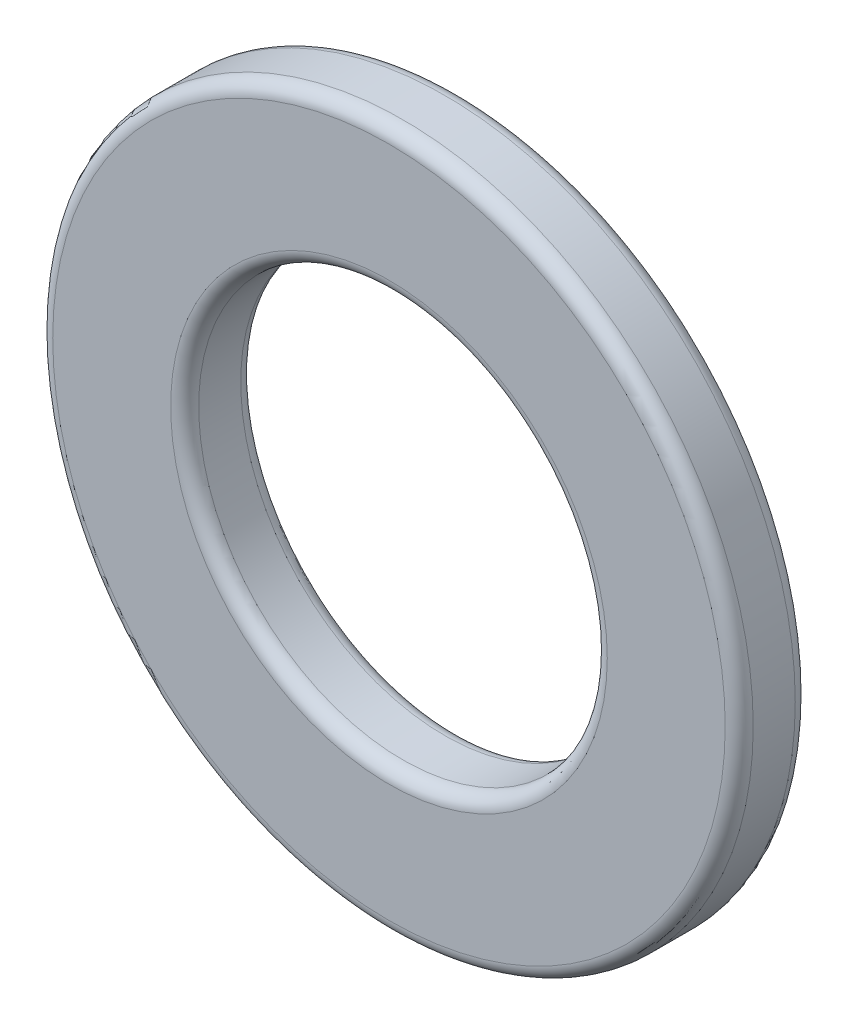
ISO-10303-21;
HEADER;
FILE_DESCRIPTION(('STEP AP214'),'2;1');
FILE_NAME('part.step','',(''),(''),'','','');
FILE_SCHEMA(('AUTOMOTIVE_DESIGN { 1 0 10303 214 1 1 1 1 }'));
ENDSEC;
DATA;
#1=APPLICATION_CONTEXT('core data for automotive mechanical design processes');
#2=APPLICATION_PROTOCOL_DEFINITION('international standard','automotive_design',2000,#1);
#3=PRODUCT_CONTEXT('',#1,'mechanical');
#4=PRODUCT('Part','Part','',(#3));
#5=PRODUCT_RELATED_PRODUCT_CATEGORY('part','',(#4));
#6=PRODUCT_DEFINITION_FORMATION('','',#4);
#7=PRODUCT_DEFINITION_CONTEXT('part definition',#1,'design');
#8=PRODUCT_DEFINITION('design','',#6,#7);
#9=PRODUCT_DEFINITION_SHAPE('','',#8);
#10=(LENGTH_UNIT() NAMED_UNIT(*) SI_UNIT(.MILLI.,.METRE.));
#11=(NAMED_UNIT(*) PLANE_ANGLE_UNIT() SI_UNIT($,.RADIAN.));
#12=(NAMED_UNIT(*) SI_UNIT($,.STERADIAN.) SOLID_ANGLE_UNIT());
#13=UNCERTAINTY_MEASURE_WITH_UNIT(LENGTH_MEASURE(1.E-05),#10,'distance_accuracy_value','');
#14=(GEOMETRIC_REPRESENTATION_CONTEXT(3) GLOBAL_UNCERTAINTY_ASSIGNED_CONTEXT((#13)) GLOBAL_UNIT_ASSIGNED_CONTEXT((#10,
#11,#12)) REPRESENTATION_CONTEXT('',''));
#15=CARTESIAN_POINT('',(0.,0.,0.));
#16=DIRECTION('',(0.,0.,1.));
#17=DIRECTION('',(1.,0.,0.));
#18=AXIS2_PLACEMENT_3D('',#15,#16,#17);
#19=CARTESIAN_POINT('',(0.,0.,-0.9));
#20=DIRECTION('',(0.,0.,1.));
#21=DIRECTION('',(1.,0.,0.));
#22=AXIS2_PLACEMENT_3D('',#19,#20,#21);
#23=CYLINDRICAL_SURFACE('',#22,9.);
#24=CARTESIAN_POINT('',(0.,0.,-0.54));
#25=DIRECTION('',(0.,0.,1.));
#26=DIRECTION('',(1.,0.,0.));
#27=AXIS2_PLACEMENT_3D('',#24,#25,#26);
#28=CIRCLE('',#27,9.);
#29=CARTESIAN_POINT('',(9.,0.,-0.54));
#30=VERTEX_POINT('',#29);
#31=EDGE_CURVE('E109',#30,#30,#28,.T.);
#32=ORIENTED_EDGE('',*,*,#31,.T.);
#33=EDGE_LOOP('',(#32));
#34=FACE_BOUND('',#33,.T.);
#35=CARTESIAN_POINT('',(0.,0.,0.54));
#36=DIRECTION('',(0.,0.,1.));
#37=DIRECTION('',(1.,0.,0.));
#38=AXIS2_PLACEMENT_3D('',#35,#36,#37);
#39=CIRCLE('',#38,9.);
#40=CARTESIAN_POINT('',(9.,0.,0.54));
#41=VERTEX_POINT('',#40);
#42=EDGE_CURVE('E112',#41,#41,#39,.F.);
#43=ORIENTED_EDGE('',*,*,#42,.T.);
#44=EDGE_LOOP('',(#43));
#45=FACE_BOUND('',#44,.T.);
#46=ADVANCED_FACE('F83',(#34,#45),#23,.T.);
#47=CARTESIAN_POINT('',(0.,0.,-0.9));
#48=DIRECTION('',(0.,0.,1.));
#49=DIRECTION('',(1.,0.,0.));
#50=AXIS2_PLACEMENT_3D('',#47,#48,#49);
#51=PLANE('',#50);
#52=CARTESIAN_POINT('',(0.,0.,-0.9));
#53=DIRECTION('',(0.,0.,1.));
#54=DIRECTION('',(1.,0.,0.));
#55=AXIS2_PLACEMENT_3D('',#52,#53,#54);
#56=CIRCLE('',#55,8.64);
#57=CARTESIAN_POINT('',(8.64,0.,-0.9));
#58=VERTEX_POINT('',#57);
#59=EDGE_CURVE('E103',#58,#58,#56,.F.);
#60=ORIENTED_EDGE('',*,*,#59,.T.);
#61=EDGE_LOOP('',(#60));
#62=FACE_BOUND('',#61,.T.);
#63=CARTESIAN_POINT('',(0.,0.,-0.9));
#64=DIRECTION('',(0.,0.,1.));
#65=DIRECTION('',(1.,0.,0.));
#66=AXIS2_PLACEMENT_3D('',#63,#64,#65);
#67=CIRCLE('',#66,5.61);
#68=CARTESIAN_POINT('',(5.61,0.,-0.9));
#69=VERTEX_POINT('',#68);
#70=EDGE_CURVE('E106',#69,#69,#67,.T.);
#71=ORIENTED_EDGE('',*,*,#70,.T.);
#72=EDGE_LOOP('',(#71));
#73=FACE_BOUND('',#72,.T.);
#74=ADVANCED_FACE('F126',(#62,#73),#51,.F.);
#75=CARTESIAN_POINT('',(0.,0.,-0.9));
#76=DIRECTION('',(0.,0.,1.));
#77=DIRECTION('',(1.,0.,0.));
#78=AXIS2_PLACEMENT_3D('',#75,#76,#77);
#79=CYLINDRICAL_SURFACE('',#78,5.25);
#80=CARTESIAN_POINT('',(0.,0.,-0.54));
#81=DIRECTION('',(0.,0.,1.));
#82=DIRECTION('',(1.,0.,0.));
#83=AXIS2_PLACEMENT_3D('',#80,#81,#82);
#84=CIRCLE('',#83,5.25);
#85=CARTESIAN_POINT('',(5.25,0.,-0.54));
#86=VERTEX_POINT('',#85);
#87=EDGE_CURVE('E94',#86,#86,#84,.F.);
#88=ORIENTED_EDGE('',*,*,#87,.T.);
#89=EDGE_LOOP('',(#88));
#90=FACE_BOUND('',#89,.T.);
#91=CARTESIAN_POINT('',(0.,0.,0.54));
#92=DIRECTION('',(0.,0.,1.));
#93=DIRECTION('',(1.,0.,0.));
#94=AXIS2_PLACEMENT_3D('',#91,#92,#93);
#95=CIRCLE('',#94,5.25);
#96=CARTESIAN_POINT('',(5.25,0.,0.54));
#97=VERTEX_POINT('',#96);
#98=EDGE_CURVE('E98',#97,#97,#95,.T.);
#99=ORIENTED_EDGE('',*,*,#98,.T.);
#100=EDGE_LOOP('',(#99));
#101=FACE_BOUND('',#100,.T.);
#102=ADVANCED_FACE('F132',(#90,#101),#79,.F.);
#103=CARTESIAN_POINT('',(0.,0.,0.9));
#104=DIRECTION('',(0.,0.,1.));
#105=DIRECTION('',(1.,0.,0.));
#106=AXIS2_PLACEMENT_3D('',#103,#104,#105);
#107=PLANE('',#106);
#108=CARTESIAN_POINT('',(0.,0.,0.9));
#109=DIRECTION('',(0.,0.,1.));
#110=DIRECTION('',(1.,0.,0.));
#111=AXIS2_PLACEMENT_3D('',#108,#109,#110);
#112=CIRCLE('',#111,5.61);
#113=CARTESIAN_POINT('',(5.61,0.,0.9));
#114=VERTEX_POINT('',#113);
#115=EDGE_CURVE('E11',#114,#114,#112,.F.);
#116=ORIENTED_EDGE('',*,*,#115,.T.);
#117=EDGE_LOOP('',(#116));
#118=FACE_BOUND('',#117,.T.);
#119=CARTESIAN_POINT('',(0.,0.,0.9));
#120=DIRECTION('',(0.,0.,1.));
#121=DIRECTION('',(1.,0.,0.));
#122=AXIS2_PLACEMENT_3D('',#119,#120,#121);
#123=CIRCLE('',#122,8.64);
#124=CARTESIAN_POINT('',(8.64,0.,0.9));
#125=VERTEX_POINT('',#124);
#126=EDGE_CURVE('E90',#125,#125,#123,.T.);
#127=ORIENTED_EDGE('',*,*,#126,.T.);
#128=EDGE_LOOP('',(#127));
#129=FACE_BOUND('',#128,.T.);
#130=ADVANCED_FACE('F140',(#118,#129),#107,.T.);
#131=CARTESIAN_POINT('',(0.,0.,-0.54));
#132=DIRECTION('',(0.,0.,1.));
#133=DIRECTION('',(1.,0.,0.));
#134=AXIS2_PLACEMENT_3D('',#131,#132,#133);
#135=TOROIDAL_SURFACE('',#134,8.64,0.36);
#136=ORIENTED_EDGE('',*,*,#59,.F.);
#137=EDGE_LOOP('',(#136));
#138=FACE_BOUND('',#137,.T.);
#139=ORIENTED_EDGE('',*,*,#31,.F.);
#140=EDGE_LOOP('',(#139));
#141=FACE_BOUND('',#140,.T.);
#142=ADVANCED_FACE('F137',(#138,#141),#135,.T.);
#143=CARTESIAN_POINT('',(0.,0.,-0.54));
#144=DIRECTION('',(0.,0.,1.));
#145=DIRECTION('',(1.,0.,0.));
#146=AXIS2_PLACEMENT_3D('',#143,#144,#145);
#147=TOROIDAL_SURFACE('',#146,5.61,0.36);
#148=ORIENTED_EDGE('',*,*,#87,.F.);
#149=EDGE_LOOP('',(#148));
#150=FACE_BOUND('',#149,.T.);
#151=ORIENTED_EDGE('',*,*,#70,.F.);
#152=EDGE_LOOP('',(#151));
#153=FACE_BOUND('',#152,.T.);
#154=ADVANCED_FACE('F123',(#150,#153),#147,.T.);
#155=CARTESIAN_POINT('',(0.,0.,0.54));
#156=DIRECTION('',(0.,0.,1.));
#157=DIRECTION('',(1.,0.,0.));
#158=AXIS2_PLACEMENT_3D('',#155,#156,#157);
#159=TOROIDAL_SURFACE('',#158,5.61,0.36);
#160=ORIENTED_EDGE('',*,*,#115,.F.);
#161=EDGE_LOOP('',(#160));
#162=FACE_BOUND('',#161,.T.);
#163=ORIENTED_EDGE('',*,*,#98,.F.);
#164=EDGE_LOOP('',(#163));
#165=FACE_BOUND('',#164,.T.);
#166=ADVANCED_FACE('F119',(#162,#165),#159,.T.);
#167=CARTESIAN_POINT('',(0.,0.,0.54));
#168=DIRECTION('',(0.,0.,1.));
#169=DIRECTION('',(1.,0.,0.));
#170=AXIS2_PLACEMENT_3D('',#167,#168,#169);
#171=TOROIDAL_SURFACE('',#170,8.64,0.36);
#172=ORIENTED_EDGE('',*,*,#42,.F.);
#173=EDGE_LOOP('',(#172));
#174=FACE_BOUND('',#173,.T.);
#175=ORIENTED_EDGE('',*,*,#126,.F.);
#176=EDGE_LOOP('',(#175));
#177=FACE_BOUND('',#176,.T.);
#178=ADVANCED_FACE('F85',(#174,#177),#171,.T.);
#179=CLOSED_SHELL('',(#46,#74,#102,#130,#142,#154,#166,#178));
#180=MANIFOLD_SOLID_BREP('B2',#179);
#181=ADVANCED_BREP_SHAPE_REPRESENTATION('',(#18,#180),#14);
#182=SHAPE_DEFINITION_REPRESENTATION(#9,#181);
ENDSEC;
END-ISO-10303-21;
